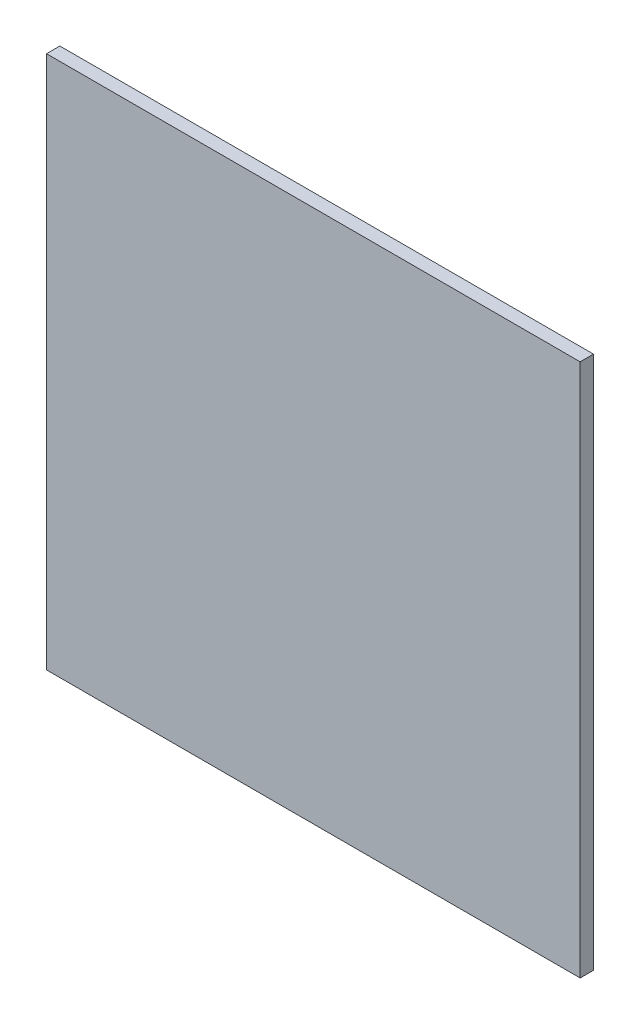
from build123d import *

# Parameters (mm, degrees)
SKETCH1_W           = 200
SKETCH1_H           = 5
BOSS_EXTRUDE1_DEPTH = 200


with BuildPart() as part:
    # Sketch1 → Boss-Extrude1 (new body)
    with BuildSketch(Plane(origin=(0, 0, 0), x_dir=(1, 0, 0), z_dir=(0, 1, 0))):
        Rectangle(SKETCH1_W, SKETCH1_H)
    extrude(amount=BOSS_EXTRUDE1_DEPTH)


solid = part.part
